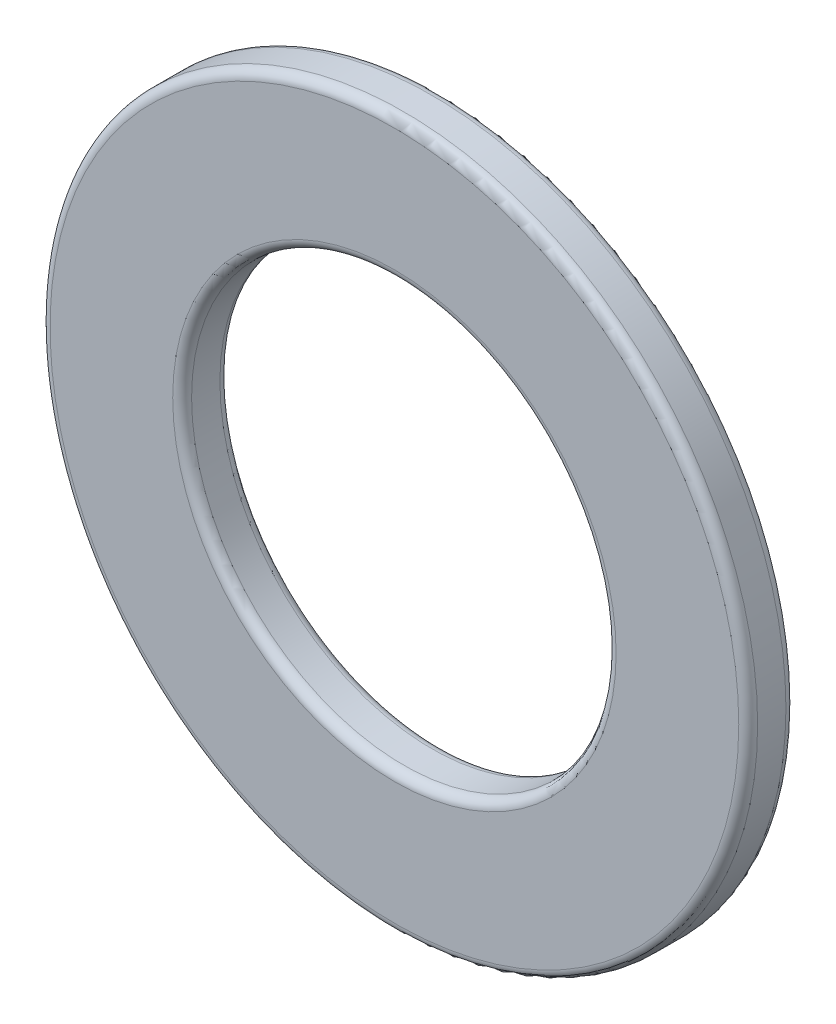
ISO-10303-21;
HEADER;
FILE_DESCRIPTION(('STEP AP214'),'2;1');
FILE_NAME('part.step','',(''),(''),'','','');
FILE_SCHEMA(('AUTOMOTIVE_DESIGN { 1 0 10303 214 1 1 1 1 }'));
ENDSEC;
DATA;
#1=APPLICATION_CONTEXT('core data for automotive mechanical design processes');
#2=APPLICATION_PROTOCOL_DEFINITION('international standard','automotive_design',2000,#1);
#3=PRODUCT_CONTEXT('',#1,'mechanical');
#4=PRODUCT('Part','Part','',(#3));
#5=PRODUCT_RELATED_PRODUCT_CATEGORY('part','',(#4));
#6=PRODUCT_DEFINITION_FORMATION('','',#4);
#7=PRODUCT_DEFINITION_CONTEXT('part definition',#1,'design');
#8=PRODUCT_DEFINITION('design','',#6,#7);
#9=PRODUCT_DEFINITION_SHAPE('','',#8);
#10=(LENGTH_UNIT() NAMED_UNIT(*) SI_UNIT(.MILLI.,.METRE.));
#11=(NAMED_UNIT(*) PLANE_ANGLE_UNIT() SI_UNIT($,.RADIAN.));
#12=(NAMED_UNIT(*) SI_UNIT($,.STERADIAN.) SOLID_ANGLE_UNIT());
#13=UNCERTAINTY_MEASURE_WITH_UNIT(LENGTH_MEASURE(1.E-05),#10,'distance_accuracy_value','');
#14=(GEOMETRIC_REPRESENTATION_CONTEXT(3) GLOBAL_UNCERTAINTY_ASSIGNED_CONTEXT((#13)) GLOBAL_UNIT_ASSIGNED_CONTEXT((#10,
#11,#12)) REPRESENTATION_CONTEXT('',''));
#15=CARTESIAN_POINT('',(0.,0.,0.));
#16=DIRECTION('',(0.,0.,1.));
#17=DIRECTION('',(1.,0.,0.));
#18=AXIS2_PLACEMENT_3D('',#15,#16,#17);
#19=CARTESIAN_POINT('',(0.,0.,0.5));
#20=DIRECTION('',(0.,0.,1.));
#21=DIRECTION('',(1.,0.,0.));
#22=AXIS2_PLACEMENT_3D('',#19,#20,#21);
#23=PLANE('',#22);
#24=CARTESIAN_POINT('',(0.,0.,0.5));
#25=DIRECTION('',(0.,0.,1.));
#26=DIRECTION('',(1.,0.,0.));
#27=AXIS2_PLACEMENT_3D('',#24,#25,#26);
#28=CIRCLE('',#27,7.3);
#29=CARTESIAN_POINT('',(7.3,0.,0.5));
#30=VERTEX_POINT('',#29);
#31=EDGE_CURVE('E40',#30,#30,#28,.T.);
#32=ORIENTED_EDGE('',*,*,#31,.T.);
#33=EDGE_LOOP('',(#32));
#34=FACE_BOUND('',#33,.T.);
#35=CARTESIAN_POINT('',(0.,0.,0.5));
#36=DIRECTION('',(0.,0.,1.));
#37=DIRECTION('',(1.,0.,0.));
#38=AXIS2_PLACEMENT_3D('',#35,#36,#37);
#39=CIRCLE('',#38,4.7);
#40=CARTESIAN_POINT('',(4.7,0.,0.5));
#41=VERTEX_POINT('',#40);
#42=EDGE_CURVE('E44',#41,#41,#39,.F.);
#43=ORIENTED_EDGE('',*,*,#42,.T.);
#44=EDGE_LOOP('',(#43));
#45=FACE_BOUND('',#44,.T.);
#46=ADVANCED_FACE('F29',(#34,#45),#23,.T.);
#47=CARTESIAN_POINT('',(0.,0.,-0.5));
#48=DIRECTION('',(0.,0.,1.));
#49=DIRECTION('',(1.,0.,0.));
#50=AXIS2_PLACEMENT_3D('',#47,#48,#49);
#51=PLANE('',#50);
#52=CARTESIAN_POINT('',(0.,0.,-0.5));
#53=DIRECTION('',(0.,0.,1.));
#54=DIRECTION('',(1.,0.,0.));
#55=AXIS2_PLACEMENT_3D('',#52,#53,#54);
#56=CIRCLE('',#55,7.3);
#57=CARTESIAN_POINT('',(7.3,0.,-0.5));
#58=VERTEX_POINT('',#57);
#59=EDGE_CURVE('E49',#58,#58,#56,.F.);
#60=ORIENTED_EDGE('',*,*,#59,.T.);
#61=EDGE_LOOP('',(#60));
#62=FACE_BOUND('',#61,.T.);
#63=CARTESIAN_POINT('',(0.,0.,-0.5));
#64=DIRECTION('',(0.,0.,1.));
#65=DIRECTION('',(1.,0.,0.));
#66=AXIS2_PLACEMENT_3D('',#63,#64,#65);
#67=CIRCLE('',#66,4.7);
#68=CARTESIAN_POINT('',(4.7,0.,-0.5));
#69=VERTEX_POINT('',#68);
#70=EDGE_CURVE('E52',#69,#69,#67,.T.);
#71=ORIENTED_EDGE('',*,*,#70,.T.);
#72=EDGE_LOOP('',(#71));
#73=FACE_BOUND('',#72,.T.);
#74=ADVANCED_FACE('F74',(#62,#73),#51,.F.);
#75=CARTESIAN_POINT('',(0.,0.,0.5));
#76=DIRECTION('',(0.,0.,-1.));
#77=DIRECTION('',(-1.,0.,0.));
#78=AXIS2_PLACEMENT_3D('',#75,#76,#77);
#79=CYLINDRICAL_SURFACE('',#78,7.5);
#80=CARTESIAN_POINT('',(0.,0.,-0.3));
#81=DIRECTION('',(0.,0.,1.));
#82=DIRECTION('',(1.,0.,0.));
#83=AXIS2_PLACEMENT_3D('',#80,#81,#82);
#84=CIRCLE('',#83,7.5);
#85=CARTESIAN_POINT('',(7.5,0.,-0.3));
#86=VERTEX_POINT('',#85);
#87=EDGE_CURVE('E55',#86,#86,#84,.T.);
#88=ORIENTED_EDGE('',*,*,#87,.T.);
#89=EDGE_LOOP('',(#88));
#90=FACE_BOUND('',#89,.T.);
#91=CARTESIAN_POINT('',(0.,0.,0.3));
#92=DIRECTION('',(0.,0.,1.));
#93=DIRECTION('',(1.,0.,0.));
#94=AXIS2_PLACEMENT_3D('',#91,#92,#93);
#95=CIRCLE('',#94,7.5);
#96=CARTESIAN_POINT('',(7.5,0.,0.3));
#97=VERTEX_POINT('',#96);
#98=EDGE_CURVE('E58',#97,#97,#95,.F.);
#99=ORIENTED_EDGE('',*,*,#98,.T.);
#100=EDGE_LOOP('',(#99));
#101=FACE_BOUND('',#100,.T.);
#102=ADVANCED_FACE('F62',(#90,#101),#79,.T.);
#103=CARTESIAN_POINT('',(0.,0.,0.5));
#104=DIRECTION('',(0.,0.,-1.));
#105=DIRECTION('',(-1.,0.,0.));
#106=AXIS2_PLACEMENT_3D('',#103,#104,#105);
#107=CYLINDRICAL_SURFACE('',#106,4.5);
#108=CARTESIAN_POINT('',(0.,0.,-0.3));
#109=DIRECTION('',(0.,0.,1.));
#110=DIRECTION('',(1.,0.,0.));
#111=AXIS2_PLACEMENT_3D('',#108,#109,#110);
#112=CIRCLE('',#111,4.5);
#113=CARTESIAN_POINT('',(4.5,0.,-0.3));
#114=VERTEX_POINT('',#113);
#115=EDGE_CURVE('E10',#114,#114,#112,.F.);
#116=ORIENTED_EDGE('',*,*,#115,.T.);
#117=EDGE_LOOP('',(#116));
#118=FACE_BOUND('',#117,.T.);
#119=CARTESIAN_POINT('',(0.,0.,0.3));
#120=DIRECTION('',(0.,0.,1.));
#121=DIRECTION('',(1.,0.,0.));
#122=AXIS2_PLACEMENT_3D('',#119,#120,#121);
#123=CIRCLE('',#122,4.5);
#124=CARTESIAN_POINT('',(4.5,0.,0.3));
#125=VERTEX_POINT('',#124);
#126=EDGE_CURVE('E36',#125,#125,#123,.T.);
#127=ORIENTED_EDGE('',*,*,#126,.T.);
#128=EDGE_LOOP('',(#127));
#129=FACE_BOUND('',#128,.T.);
#130=ADVANCED_FACE('F90',(#118,#129),#107,.F.);
#131=CARTESIAN_POINT('',(0.,0.,-0.3));
#132=DIRECTION('',(0.,0.,1.));
#133=DIRECTION('',(1.,0.,0.));
#134=AXIS2_PLACEMENT_3D('',#131,#132,#133);
#135=TOROIDAL_SURFACE('',#134,7.3,0.2);
#136=ORIENTED_EDGE('',*,*,#59,.F.);
#137=EDGE_LOOP('',(#136));
#138=FACE_BOUND('',#137,.T.);
#139=ORIENTED_EDGE('',*,*,#87,.F.);
#140=EDGE_LOOP('',(#139));
#141=FACE_BOUND('',#140,.T.);
#142=ADVANCED_FACE('F68',(#138,#141),#135,.T.);
#143=CARTESIAN_POINT('',(0.,0.,0.3));
#144=DIRECTION('',(0.,0.,1.));
#145=DIRECTION('',(1.,0.,0.));
#146=AXIS2_PLACEMENT_3D('',#143,#144,#145);
#147=TOROIDAL_SURFACE('',#146,7.3,0.2);
#148=ORIENTED_EDGE('',*,*,#98,.F.);
#149=EDGE_LOOP('',(#148));
#150=FACE_BOUND('',#149,.T.);
#151=ORIENTED_EDGE('',*,*,#31,.F.);
#152=EDGE_LOOP('',(#151));
#153=FACE_BOUND('',#152,.T.);
#154=ADVANCED_FACE('F64',(#150,#153),#147,.T.);
#155=CARTESIAN_POINT('',(0.,0.,-0.3));
#156=DIRECTION('',(0.,0.,1.));
#157=DIRECTION('',(1.,0.,0.));
#158=AXIS2_PLACEMENT_3D('',#155,#156,#157);
#159=TOROIDAL_SURFACE('',#158,4.7,0.2);
#160=ORIENTED_EDGE('',*,*,#115,.F.);
#161=EDGE_LOOP('',(#160));
#162=FACE_BOUND('',#161,.T.);
#163=ORIENTED_EDGE('',*,*,#70,.F.);
#164=EDGE_LOOP('',(#163));
#165=FACE_BOUND('',#164,.T.);
#166=ADVANCED_FACE('F67',(#162,#165),#159,.T.);
#167=CARTESIAN_POINT('',(0.,0.,0.3));
#168=DIRECTION('',(0.,0.,1.));
#169=DIRECTION('',(1.,0.,0.));
#170=AXIS2_PLACEMENT_3D('',#167,#168,#169);
#171=TOROIDAL_SURFACE('',#170,4.7,0.2);
#172=ORIENTED_EDGE('',*,*,#42,.F.);
#173=EDGE_LOOP('',(#172));
#174=FACE_BOUND('',#173,.T.);
#175=ORIENTED_EDGE('',*,*,#126,.F.);
#176=EDGE_LOOP('',(#175));
#177=FACE_BOUND('',#176,.T.);
#178=ADVANCED_FACE('F31',(#174,#177),#171,.T.);
#179=CLOSED_SHELL('',(#46,#74,#102,#130,#142,#154,#166,#178));
#180=MANIFOLD_SOLID_BREP('B2',#179);
#181=ADVANCED_BREP_SHAPE_REPRESENTATION('',(#18,#180),#14);
#182=SHAPE_DEFINITION_REPRESENTATION(#9,#181);
ENDSEC;
END-ISO-10303-21;
